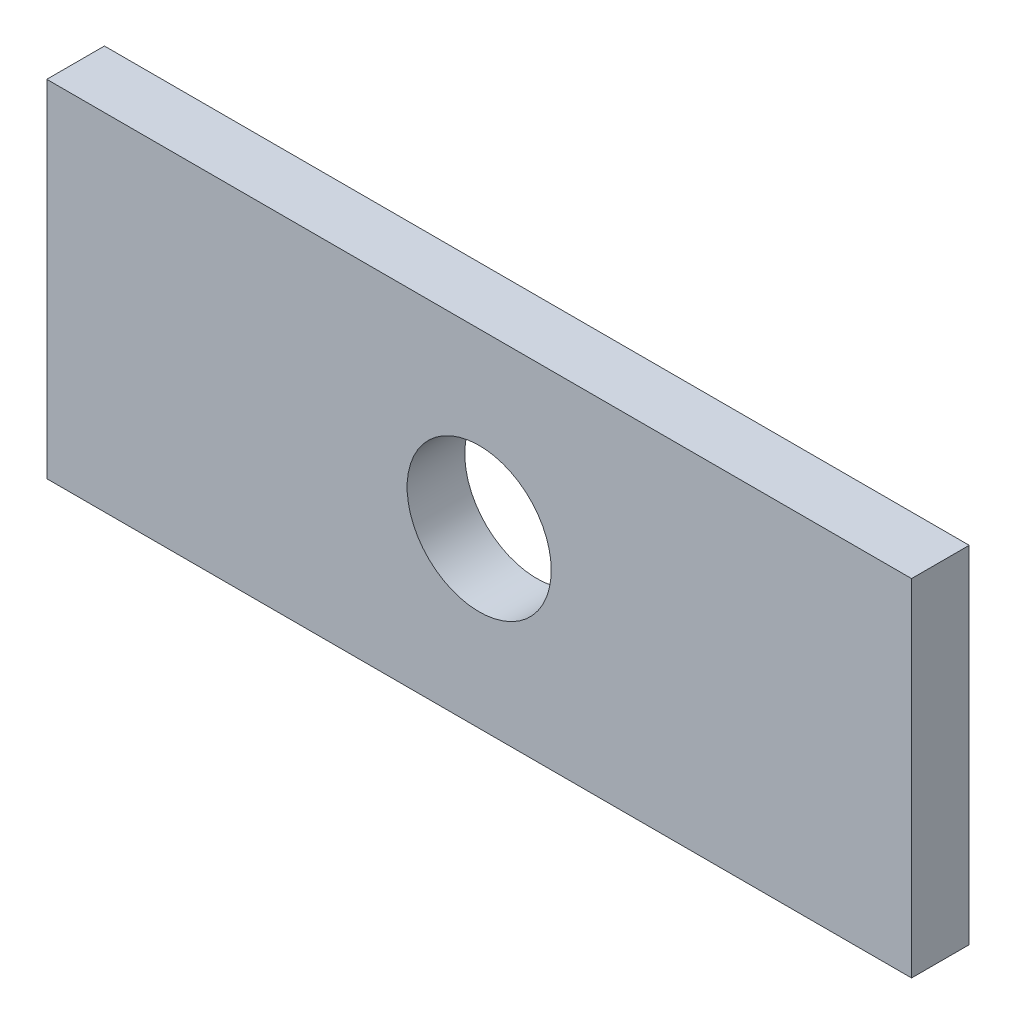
ISO-10303-21;
HEADER;
FILE_DESCRIPTION(('STEP AP214'),'2;1');
FILE_NAME('part.step','',(''),(''),'','','');
FILE_SCHEMA(('AUTOMOTIVE_DESIGN { 1 0 10303 214 1 1 1 1 }'));
ENDSEC;
DATA;
#1=APPLICATION_CONTEXT('core data for automotive mechanical design processes');
#2=APPLICATION_PROTOCOL_DEFINITION('international standard','automotive_design',2000,#1);
#3=PRODUCT_CONTEXT('',#1,'mechanical');
#4=PRODUCT('Part','Part','',(#3));
#5=PRODUCT_RELATED_PRODUCT_CATEGORY('part','',(#4));
#6=PRODUCT_DEFINITION_FORMATION('','',#4);
#7=PRODUCT_DEFINITION_CONTEXT('part definition',#1,'design');
#8=PRODUCT_DEFINITION('design','',#6,#7);
#9=PRODUCT_DEFINITION_SHAPE('','',#8);
#10=(LENGTH_UNIT() NAMED_UNIT(*) SI_UNIT(.MILLI.,.METRE.));
#11=(NAMED_UNIT(*) PLANE_ANGLE_UNIT() SI_UNIT($,.RADIAN.));
#12=(NAMED_UNIT(*) SI_UNIT($,.STERADIAN.) SOLID_ANGLE_UNIT());
#13=UNCERTAINTY_MEASURE_WITH_UNIT(LENGTH_MEASURE(1.E-05),#10,'distance_accuracy_value','');
#14=(GEOMETRIC_REPRESENTATION_CONTEXT(3) GLOBAL_UNCERTAINTY_ASSIGNED_CONTEXT((#13)) GLOBAL_UNIT_ASSIGNED_CONTEXT((#10,
#11,#12)) REPRESENTATION_CONTEXT('',''));
#15=CARTESIAN_POINT('',(0.,0.,0.));
#16=DIRECTION('',(0.,0.,1.));
#17=DIRECTION('',(1.,0.,0.));
#18=AXIS2_PLACEMENT_3D('',#15,#16,#17);
#19=CARTESIAN_POINT('',(-75.,-30.,10.));
#20=DIRECTION('',(0.,1.,0.));
#21=DIRECTION('',(-1.,0.,0.));
#22=AXIS2_PLACEMENT_3D('',#19,#20,#21);
#23=PLANE('',#22);
#24=DIRECTION('',(1.,0.,0.));
#25=VECTOR('',#24,1.);
#26=CARTESIAN_POINT('',(-75.,-30.,0.));
#27=LINE('',#26,#25);
#28=CARTESIAN_POINT('',(-75.,-30.,0.));
#29=VERTEX_POINT('',#28);
#30=CARTESIAN_POINT('',(75.,-30.,0.));
#31=VERTEX_POINT('',#30);
#32=EDGE_CURVE('E108',#29,#31,#27,.T.);
#33=ORIENTED_EDGE('',*,*,#32,.T.);
#34=DIRECTION('',(0.,0.,-1.));
#35=VECTOR('',#34,1.);
#36=CARTESIAN_POINT('',(75.,-30.,10.));
#37=LINE('',#36,#35);
#38=CARTESIAN_POINT('',(75.,-30.,10.));
#39=VERTEX_POINT('',#38);
#40=EDGE_CURVE('E12',#39,#31,#37,.T.);
#41=ORIENTED_EDGE('',*,*,#40,.F.);
#42=DIRECTION('',(1.,0.,0.));
#43=VECTOR('',#42,1.);
#44=CARTESIAN_POINT('',(-75.,-30.,10.));
#45=LINE('',#44,#43);
#46=CARTESIAN_POINT('',(-75.,-30.,10.));
#47=VERTEX_POINT('',#46);
#48=EDGE_CURVE('E94',#47,#39,#45,.T.);
#49=ORIENTED_EDGE('',*,*,#48,.F.);
#50=DIRECTION('',(0.,0.,-1.));
#51=VECTOR('',#50,1.);
#52=CARTESIAN_POINT('',(-75.,-30.,10.));
#53=LINE('',#52,#51);
#54=EDGE_CURVE('E61',#47,#29,#53,.T.);
#55=ORIENTED_EDGE('',*,*,#54,.T.);
#56=EDGE_LOOP('',(#33,#41,#49,#55));
#57=FACE_BOUND('',#56,.T.);
#58=ADVANCED_FACE('F45',(#57),#23,.F.);
#59=CARTESIAN_POINT('',(75.,-30.,10.));
#60=DIRECTION('',(-1.,0.,0.));
#61=DIRECTION('',(0.,0.,1.));
#62=AXIS2_PLACEMENT_3D('',#59,#60,#61);
#63=PLANE('',#62);
#64=DIRECTION('',(0.,1.,0.));
#65=VECTOR('',#64,1.);
#66=CARTESIAN_POINT('',(75.,-30.,0.));
#67=LINE('',#66,#65);
#68=CARTESIAN_POINT('',(75.,30.,0.));
#69=VERTEX_POINT('',#68);
#70=EDGE_CURVE('E99',#31,#69,#67,.T.);
#71=ORIENTED_EDGE('',*,*,#70,.T.);
#72=DIRECTION('',(0.,0.,-1.));
#73=VECTOR('',#72,1.);
#74=CARTESIAN_POINT('',(75.,30.,10.));
#75=LINE('',#74,#73);
#76=CARTESIAN_POINT('',(75.,30.,10.));
#77=VERTEX_POINT('',#76);
#78=EDGE_CURVE('E53',#77,#69,#75,.T.);
#79=ORIENTED_EDGE('',*,*,#78,.F.);
#80=DIRECTION('',(0.,1.,0.));
#81=VECTOR('',#80,1.);
#82=CARTESIAN_POINT('',(75.,-30.,10.));
#83=LINE('',#82,#81);
#84=EDGE_CURVE('E86',#39,#77,#83,.T.);
#85=ORIENTED_EDGE('',*,*,#84,.F.);
#86=ORIENTED_EDGE('',*,*,#40,.T.);
#87=EDGE_LOOP('',(#71,#79,#85,#86));
#88=FACE_BOUND('',#87,.T.);
#89=ADVANCED_FACE('F98',(#88),#63,.F.);
#90=CARTESIAN_POINT('',(-75.,30.,10.));
#91=DIRECTION('',(0.,1.,0.));
#92=DIRECTION('',(-1.,0.,0.));
#93=AXIS2_PLACEMENT_3D('',#90,#91,#92);
#94=PLANE('',#93);
#95=DIRECTION('',(1.,0.,0.));
#96=VECTOR('',#95,1.);
#97=CARTESIAN_POINT('',(-75.,30.,0.));
#98=LINE('',#97,#96);
#99=CARTESIAN_POINT('',(-75.,30.,0.));
#100=VERTEX_POINT('',#99);
#101=EDGE_CURVE('E112',#100,#69,#98,.T.);
#102=ORIENTED_EDGE('',*,*,#101,.F.);
#103=DIRECTION('',(0.,0.,-1.));
#104=VECTOR('',#103,1.);
#105=CARTESIAN_POINT('',(-75.,30.,10.));
#106=LINE('',#105,#104);
#107=CARTESIAN_POINT('',(-75.,30.,10.));
#108=VERTEX_POINT('',#107);
#109=EDGE_CURVE('E75',#108,#100,#106,.T.);
#110=ORIENTED_EDGE('',*,*,#109,.F.);
#111=DIRECTION('',(1.,0.,0.));
#112=VECTOR('',#111,1.);
#113=CARTESIAN_POINT('',(-75.,30.,10.));
#114=LINE('',#113,#112);
#115=EDGE_CURVE('E93',#108,#77,#114,.T.);
#116=ORIENTED_EDGE('',*,*,#115,.T.);
#117=ORIENTED_EDGE('',*,*,#78,.T.);
#118=EDGE_LOOP('',(#102,#110,#116,#117));
#119=FACE_BOUND('',#118,.T.);
#120=ADVANCED_FACE('F102',(#119),#94,.T.);
#121=CARTESIAN_POINT('',(-75.,-30.,10.));
#122=DIRECTION('',(-1.,0.,0.));
#123=DIRECTION('',(0.,-1.,0.));
#124=AXIS2_PLACEMENT_3D('',#121,#122,#123);
#125=PLANE('',#124);
#126=DIRECTION('',(0.,1.,0.));
#127=VECTOR('',#126,1.);
#128=CARTESIAN_POINT('',(-75.,-30.,0.));
#129=LINE('',#128,#127);
#130=EDGE_CURVE('E114',#29,#100,#129,.T.);
#131=ORIENTED_EDGE('',*,*,#130,.F.);
#132=ORIENTED_EDGE('',*,*,#54,.F.);
#133=DIRECTION('',(0.,1.,0.));
#134=VECTOR('',#133,1.);
#135=CARTESIAN_POINT('',(-75.,-30.,10.));
#136=LINE('',#135,#134);
#137=EDGE_CURVE('E103',#47,#108,#136,.T.);
#138=ORIENTED_EDGE('',*,*,#137,.T.);
#139=ORIENTED_EDGE('',*,*,#109,.T.);
#140=EDGE_LOOP('',(#131,#132,#138,#139));
#141=FACE_BOUND('',#140,.T.);
#142=ADVANCED_FACE('F137',(#141),#125,.T.);
#143=CARTESIAN_POINT('',(0.,0.,10.));
#144=DIRECTION('',(0.,0.,1.));
#145=DIRECTION('',(1.,0.,0.));
#146=AXIS2_PLACEMENT_3D('',#143,#144,#145);
#147=PLANE('',#146);
#148=CARTESIAN_POINT('',(0.,0.,10.));
#149=DIRECTION('',(0.,0.,1.));
#150=DIRECTION('',(1.,0.,0.));
#151=AXIS2_PLACEMENT_3D('',#148,#149,#150);
#152=CIRCLE('',#151,12.5);
#153=CARTESIAN_POINT('',(12.5,0.,10.));
#154=VERTEX_POINT('',#153);
#155=EDGE_CURVE('E119',#154,#154,#152,.T.);
#156=ORIENTED_EDGE('',*,*,#155,.F.);
#157=EDGE_LOOP('',(#156));
#158=FACE_BOUND('',#157,.T.);
#159=ORIENTED_EDGE('',*,*,#48,.T.);
#160=ORIENTED_EDGE('',*,*,#84,.T.);
#161=ORIENTED_EDGE('',*,*,#115,.F.);
#162=ORIENTED_EDGE('',*,*,#137,.F.);
#163=EDGE_LOOP('',(#159,#160,#161,#162));
#164=FACE_BOUND('',#163,.T.);
#165=ADVANCED_FACE('F90',(#158,#164),#147,.T.);
#166=CARTESIAN_POINT('',(0.,0.,0.));
#167=DIRECTION('',(0.,0.,1.));
#168=DIRECTION('',(1.,0.,0.));
#169=AXIS2_PLACEMENT_3D('',#166,#167,#168);
#170=PLANE('',#169);
#171=CARTESIAN_POINT('',(0.,0.,0.));
#172=DIRECTION('',(0.,0.,1.));
#173=DIRECTION('',(1.,0.,0.));
#174=AXIS2_PLACEMENT_3D('',#171,#172,#173);
#175=CIRCLE('',#174,12.5);
#176=CARTESIAN_POINT('',(12.5,0.,0.));
#177=VERTEX_POINT('',#176);
#178=EDGE_CURVE('E110',#177,#177,#175,.T.);
#179=ORIENTED_EDGE('',*,*,#178,.T.);
#180=EDGE_LOOP('',(#179));
#181=FACE_BOUND('',#180,.T.);
#182=ORIENTED_EDGE('',*,*,#32,.F.);
#183=ORIENTED_EDGE('',*,*,#130,.T.);
#184=ORIENTED_EDGE('',*,*,#101,.T.);
#185=ORIENTED_EDGE('',*,*,#70,.F.);
#186=EDGE_LOOP('',(#182,#183,#184,#185));
#187=FACE_BOUND('',#186,.T.);
#188=ADVANCED_FACE('F128',(#181,#187),#170,.F.);
#189=CARTESIAN_POINT('',(0.,0.,0.));
#190=DIRECTION('',(0.,0.,1.));
#191=DIRECTION('',(1.,0.,0.));
#192=AXIS2_PLACEMENT_3D('',#189,#190,#191);
#193=CYLINDRICAL_SURFACE('',#192,12.5);
#194=ORIENTED_EDGE('',*,*,#178,.F.);
#195=EDGE_LOOP('',(#194));
#196=FACE_BOUND('',#195,.T.);
#197=ORIENTED_EDGE('',*,*,#155,.T.);
#198=EDGE_LOOP('',(#197));
#199=FACE_BOUND('',#198,.T.);
#200=ADVANCED_FACE('F130',(#196,#199),#193,.F.);
#201=CLOSED_SHELL('',(#58,#89,#120,#142,#165,#188,#200));
#202=MANIFOLD_SOLID_BREP('B2',#201);
#203=ADVANCED_BREP_SHAPE_REPRESENTATION('',(#18,#202),#14);
#204=SHAPE_DEFINITION_REPRESENTATION(#9,#203);
ENDSEC;
END-ISO-10303-21;
